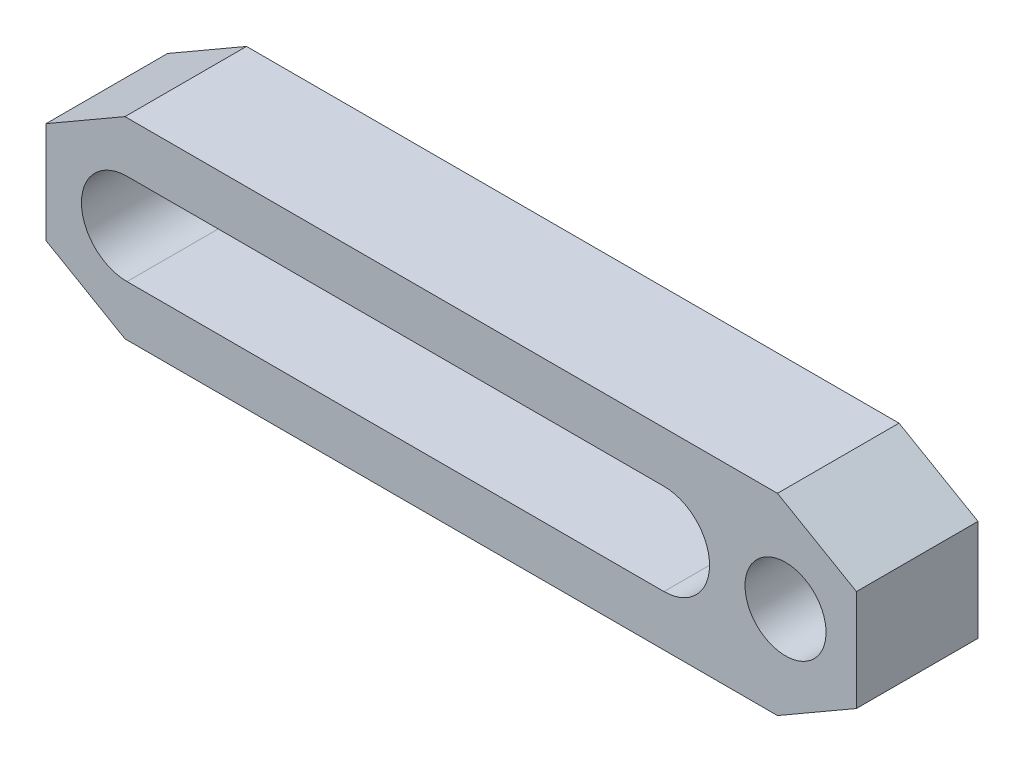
ISO-10303-21;
HEADER;
FILE_DESCRIPTION(('STEP AP214'),'2;1');
FILE_NAME('part.step','',(''),(''),'','','');
FILE_SCHEMA(('AUTOMOTIVE_DESIGN { 1 0 10303 214 1 1 1 1 }'));
ENDSEC;
DATA;
#1=APPLICATION_CONTEXT('core data for automotive mechanical design processes');
#2=APPLICATION_PROTOCOL_DEFINITION('international standard','automotive_design',2000,#1);
#3=PRODUCT_CONTEXT('',#1,'mechanical');
#4=PRODUCT('Part','Part','',(#3));
#5=PRODUCT_RELATED_PRODUCT_CATEGORY('part','',(#4));
#6=PRODUCT_DEFINITION_FORMATION('','',#4);
#7=PRODUCT_DEFINITION_CONTEXT('part definition',#1,'design');
#8=PRODUCT_DEFINITION('design','',#6,#7);
#9=PRODUCT_DEFINITION_SHAPE('','',#8);
#10=(LENGTH_UNIT() NAMED_UNIT(*) SI_UNIT(.MILLI.,.METRE.));
#11=(NAMED_UNIT(*) PLANE_ANGLE_UNIT() SI_UNIT($,.RADIAN.));
#12=(NAMED_UNIT(*) SI_UNIT($,.STERADIAN.) SOLID_ANGLE_UNIT());
#13=UNCERTAINTY_MEASURE_WITH_UNIT(LENGTH_MEASURE(1.E-05),#10,'distance_accuracy_value','');
#14=(GEOMETRIC_REPRESENTATION_CONTEXT(3) GLOBAL_UNCERTAINTY_ASSIGNED_CONTEXT((#13)) GLOBAL_UNIT_ASSIGNED_CONTEXT((#10,
#11,#12)) REPRESENTATION_CONTEXT('',''));
#15=CARTESIAN_POINT('',(0.,0.,0.));
#16=DIRECTION('',(0.,0.,1.));
#17=DIRECTION('',(1.,0.,0.));
#18=AXIS2_PLACEMENT_3D('',#15,#16,#17);
#19=CARTESIAN_POINT('',(-21.,28.0940107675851,12.));
#20=DIRECTION('',(0.,0.,1.));
#21=DIRECTION('',(0.,1.,0.));
#22=AXIS2_PLACEMENT_3D('',#19,#20,#21);
#23=PLANE('',#22);
#24=CARTESIAN_POINT('',(12.,0.,12.));
#25=DIRECTION('',(0.,0.,1.));
#26=DIRECTION('',(0.,1.,0.));
#27=AXIS2_PLACEMENT_3D('',#24,#25,#26);
#28=CIRCLE('',#27,4.);
#29=CARTESIAN_POINT('',(12.,4.,12.));
#30=VERTEX_POINT('',#29);
#31=EDGE_CURVE('E127',#30,#30,#28,.T.);
#32=ORIENTED_EDGE('',*,*,#31,.F.);
#33=EDGE_LOOP('',(#32));
#34=FACE_BOUND('',#33,.T.);
#35=DIRECTION('',(-0.866025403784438,-0.5,0.));
#36=VECTOR('',#35,1.);
#37=CARTESIAN_POINT('',(-61.,5.,12.));
#38=LINE('',#37,#36);
#39=CARTESIAN_POINT('',(-53.2057713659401,9.5,12.));
#40=VERTEX_POINT('',#39);
#41=CARTESIAN_POINT('',(-61.,5.,12.));
#42=VERTEX_POINT('',#41);
#43=EDGE_CURVE('E160',#40,#42,#38,.T.);
#44=ORIENTED_EDGE('',*,*,#43,.T.);
#45=DIRECTION('',(0.,-1.,0.));
#46=VECTOR('',#45,1.);
#47=CARTESIAN_POINT('',(-61.,-5.,12.));
#48=LINE('',#47,#46);
#49=CARTESIAN_POINT('',(-61.,-5.,12.));
#50=VERTEX_POINT('',#49);
#51=EDGE_CURVE('E163',#42,#50,#48,.T.);
#52=ORIENTED_EDGE('',*,*,#51,.T.);
#53=DIRECTION('',(0.866025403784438,-0.5,0.));
#54=VECTOR('',#53,1.);
#55=CARTESIAN_POINT('',(-61.,-5.,12.));
#56=LINE('',#55,#54);
#57=CARTESIAN_POINT('',(-53.2057713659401,-9.5,12.));
#58=VERTEX_POINT('',#57);
#59=EDGE_CURVE('E165',#50,#58,#56,.T.);
#60=ORIENTED_EDGE('',*,*,#59,.T.);
#61=DIRECTION('',(1.,0.,0.));
#62=VECTOR('',#61,1.);
#63=CARTESIAN_POINT('',(11.2057713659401,-9.5,12.));
#64=LINE('',#63,#62);
#65=CARTESIAN_POINT('',(11.2057713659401,-9.5,12.));
#66=VERTEX_POINT('',#65);
#67=EDGE_CURVE('E167',#58,#66,#64,.T.);
#68=ORIENTED_EDGE('',*,*,#67,.T.);
#69=DIRECTION('',(0.866025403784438,0.5,0.));
#70=VECTOR('',#69,1.);
#71=CARTESIAN_POINT('',(19.,-5.,12.));
#72=LINE('',#71,#70);
#73=CARTESIAN_POINT('',(19.,-5.,12.));
#74=VERTEX_POINT('',#73);
#75=EDGE_CURVE('E169',#66,#74,#72,.T.);
#76=ORIENTED_EDGE('',*,*,#75,.T.);
#77=DIRECTION('',(0.,1.,0.));
#78=VECTOR('',#77,1.);
#79=CARTESIAN_POINT('',(19.,-5.,12.));
#80=LINE('',#79,#78);
#81=CARTESIAN_POINT('',(19.,5.,12.));
#82=VERTEX_POINT('',#81);
#83=EDGE_CURVE('E171',#74,#82,#80,.T.);
#84=ORIENTED_EDGE('',*,*,#83,.T.);
#85=DIRECTION('',(-0.866025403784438,0.5,0.));
#86=VECTOR('',#85,1.);
#87=CARTESIAN_POINT('',(19.,5.,12.));
#88=LINE('',#87,#86);
#89=CARTESIAN_POINT('',(11.2057713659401,9.5,12.));
#90=VERTEX_POINT('',#89);
#91=EDGE_CURVE('E173',#82,#90,#88,.T.);
#92=ORIENTED_EDGE('',*,*,#91,.T.);
#93=DIRECTION('',(-1.,0.,0.));
#94=VECTOR('',#93,1.);
#95=CARTESIAN_POINT('',(11.2057713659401,9.5,12.));
#96=LINE('',#95,#94);
#97=EDGE_CURVE('E175',#90,#40,#96,.T.);
#98=ORIENTED_EDGE('',*,*,#97,.T.);
#99=EDGE_LOOP('',(#44,#52,#60,#68,#76,#84,#92,#98));
#100=FACE_BOUND('',#99,.T.);
#101=DIRECTION('',(-1.,0.,0.));
#102=VECTOR('',#101,1.);
#103=CARTESIAN_POINT('',(0.,4.5,12.));
#104=LINE('',#103,#102);
#105=CARTESIAN_POINT('',(0.,4.5,12.));
#106=VERTEX_POINT('',#105);
#107=CARTESIAN_POINT('',(-53.,4.5,12.));
#108=VERTEX_POINT('',#107);
#109=EDGE_CURVE('E134',#106,#108,#104,.T.);
#110=ORIENTED_EDGE('',*,*,#109,.F.);
#111=CARTESIAN_POINT('',(0.,0.,12.));
#112=DIRECTION('',(0.,0.,1.));
#113=DIRECTION('',(0.,1.,0.));
#114=AXIS2_PLACEMENT_3D('',#111,#112,#113);
#115=CIRCLE('',#114,4.5);
#116=CARTESIAN_POINT('',(0.,-4.5,12.));
#117=VERTEX_POINT('',#116);
#118=EDGE_CURVE('E118',#117,#106,#115,.T.);
#119=ORIENTED_EDGE('',*,*,#118,.F.);
#120=DIRECTION('',(1.,0.,0.));
#121=VECTOR('',#120,1.);
#122=CARTESIAN_POINT('',(0.,-4.5,12.));
#123=LINE('',#122,#121);
#124=CARTESIAN_POINT('',(-53.,-4.5,12.));
#125=VERTEX_POINT('',#124);
#126=EDGE_CURVE('E138',#125,#117,#123,.T.);
#127=ORIENTED_EDGE('',*,*,#126,.F.);
#128=CARTESIAN_POINT('',(-53.,0.,12.));
#129=DIRECTION('',(0.,0.,1.));
#130=DIRECTION('',(0.,1.,0.));
#131=AXIS2_PLACEMENT_3D('',#128,#129,#130);
#132=CIRCLE('',#131,4.5);
#133=EDGE_CURVE('E136',#108,#125,#132,.T.);
#134=ORIENTED_EDGE('',*,*,#133,.F.);
#135=EDGE_LOOP('',(#110,#119,#127,#134));
#136=FACE_BOUND('',#135,.T.);
#137=ADVANCED_FACE('F14',(#34,#100,#136),#23,.T.);
#138=CARTESIAN_POINT('',(-21.,28.0940107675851,0.));
#139=DIRECTION('',(0.,0.,1.));
#140=DIRECTION('',(0.,1.,0.));
#141=AXIS2_PLACEMENT_3D('',#138,#139,#140);
#142=PLANE('',#141);
#143=CARTESIAN_POINT('',(12.,0.,0.));
#144=DIRECTION('',(0.,0.,1.));
#145=DIRECTION('',(0.,1.,0.));
#146=AXIS2_PLACEMENT_3D('',#143,#144,#145);
#147=CIRCLE('',#146,4.);
#148=CARTESIAN_POINT('',(12.,4.,0.));
#149=VERTEX_POINT('',#148);
#150=EDGE_CURVE('E124',#149,#149,#147,.T.);
#151=ORIENTED_EDGE('',*,*,#150,.T.);
#152=EDGE_LOOP('',(#151));
#153=FACE_BOUND('',#152,.T.);
#154=DIRECTION('',(-0.866025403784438,-0.5,0.));
#155=VECTOR('',#154,1.);
#156=CARTESIAN_POINT('',(-61.,5.,0.));
#157=LINE('',#156,#155);
#158=CARTESIAN_POINT('',(-53.2057713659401,9.5,0.));
#159=VERTEX_POINT('',#158);
#160=CARTESIAN_POINT('',(-61.,5.,0.));
#161=VERTEX_POINT('',#160);
#162=EDGE_CURVE('E119',#159,#161,#157,.T.);
#163=ORIENTED_EDGE('',*,*,#162,.F.);
#164=DIRECTION('',(-1.,0.,0.));
#165=VECTOR('',#164,1.);
#166=CARTESIAN_POINT('',(11.2057713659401,9.5,0.));
#167=LINE('',#166,#165);
#168=CARTESIAN_POINT('',(11.2057713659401,9.5,0.));
#169=VERTEX_POINT('',#168);
#170=EDGE_CURVE('E158',#169,#159,#167,.T.);
#171=ORIENTED_EDGE('',*,*,#170,.F.);
#172=DIRECTION('',(-0.866025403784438,0.5,0.));
#173=VECTOR('',#172,1.);
#174=CARTESIAN_POINT('',(19.,5.,0.));
#175=LINE('',#174,#173);
#176=CARTESIAN_POINT('',(19.,5.,0.));
#177=VERTEX_POINT('',#176);
#178=EDGE_CURVE('E156',#177,#169,#175,.T.);
#179=ORIENTED_EDGE('',*,*,#178,.F.);
#180=DIRECTION('',(0.,1.,0.));
#181=VECTOR('',#180,1.);
#182=CARTESIAN_POINT('',(19.,-5.,0.));
#183=LINE('',#182,#181);
#184=CARTESIAN_POINT('',(19.,-5.,0.));
#185=VERTEX_POINT('',#184);
#186=EDGE_CURVE('E154',#185,#177,#183,.T.);
#187=ORIENTED_EDGE('',*,*,#186,.F.);
#188=DIRECTION('',(0.866025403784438,0.5,0.));
#189=VECTOR('',#188,1.);
#190=CARTESIAN_POINT('',(19.,-5.,0.));
#191=LINE('',#190,#189);
#192=CARTESIAN_POINT('',(11.2057713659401,-9.5,0.));
#193=VERTEX_POINT('',#192);
#194=EDGE_CURVE('E152',#193,#185,#191,.T.);
#195=ORIENTED_EDGE('',*,*,#194,.F.);
#196=DIRECTION('',(1.,0.,0.));
#197=VECTOR('',#196,1.);
#198=CARTESIAN_POINT('',(11.2057713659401,-9.5,0.));
#199=LINE('',#198,#197);
#200=CARTESIAN_POINT('',(-53.2057713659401,-9.5,0.));
#201=VERTEX_POINT('',#200);
#202=EDGE_CURVE('E150',#201,#193,#199,.T.);
#203=ORIENTED_EDGE('',*,*,#202,.F.);
#204=DIRECTION('',(0.866025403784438,-0.5,0.));
#205=VECTOR('',#204,1.);
#206=CARTESIAN_POINT('',(-61.,-5.,0.));
#207=LINE('',#206,#205);
#208=CARTESIAN_POINT('',(-61.,-5.,0.));
#209=VERTEX_POINT('',#208);
#210=EDGE_CURVE('E148',#209,#201,#207,.T.);
#211=ORIENTED_EDGE('',*,*,#210,.F.);
#212=DIRECTION('',(0.,-1.,0.));
#213=VECTOR('',#212,1.);
#214=CARTESIAN_POINT('',(-61.,-5.,0.));
#215=LINE('',#214,#213);
#216=EDGE_CURVE('E146',#161,#209,#215,.T.);
#217=ORIENTED_EDGE('',*,*,#216,.F.);
#218=EDGE_LOOP('',(#163,#171,#179,#187,#195,#203,#211,#217));
#219=FACE_BOUND('',#218,.T.);
#220=CARTESIAN_POINT('',(0.,0.,0.));
#221=DIRECTION('',(0.,0.,1.));
#222=DIRECTION('',(0.,1.,0.));
#223=AXIS2_PLACEMENT_3D('',#220,#221,#222);
#224=CIRCLE('',#223,4.5);
#225=CARTESIAN_POINT('',(0.,-4.5,0.));
#226=VERTEX_POINT('',#225);
#227=CARTESIAN_POINT('',(0.,4.5,0.));
#228=VERTEX_POINT('',#227);
#229=EDGE_CURVE('E37',#226,#228,#224,.T.);
#230=ORIENTED_EDGE('',*,*,#229,.T.);
#231=DIRECTION('',(-1.,0.,0.));
#232=VECTOR('',#231,1.);
#233=CARTESIAN_POINT('',(0.,4.5,0.));
#234=LINE('',#233,#232);
#235=CARTESIAN_POINT('',(-53.,4.5,0.));
#236=VERTEX_POINT('',#235);
#237=EDGE_CURVE('E105',#228,#236,#234,.T.);
#238=ORIENTED_EDGE('',*,*,#237,.T.);
#239=CARTESIAN_POINT('',(-53.,0.,0.));
#240=DIRECTION('',(0.,0.,1.));
#241=DIRECTION('',(0.,1.,0.));
#242=AXIS2_PLACEMENT_3D('',#239,#240,#241);
#243=CIRCLE('',#242,4.5);
#244=CARTESIAN_POINT('',(-53.,-4.5,0.));
#245=VERTEX_POINT('',#244);
#246=EDGE_CURVE('E114',#236,#245,#243,.T.);
#247=ORIENTED_EDGE('',*,*,#246,.T.);
#248=DIRECTION('',(1.,0.,0.));
#249=VECTOR('',#248,1.);
#250=CARTESIAN_POINT('',(0.,-4.5,0.));
#251=LINE('',#250,#249);
#252=EDGE_CURVE('E123',#245,#226,#251,.T.);
#253=ORIENTED_EDGE('',*,*,#252,.T.);
#254=EDGE_LOOP('',(#230,#238,#247,#253));
#255=FACE_BOUND('',#254,.T.);
#256=ADVANCED_FACE('F122',(#153,#219,#255),#142,.F.);
#257=CARTESIAN_POINT('',(-61.,5.,12.));
#258=DIRECTION('',(0.5,-0.866025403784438,0.));
#259=DIRECTION('',(0.866025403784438,0.5,0.));
#260=AXIS2_PLACEMENT_3D('',#257,#258,#259);
#261=PLANE('',#260);
#262=ORIENTED_EDGE('',*,*,#162,.T.);
#263=DIRECTION('',(0.,0.,-1.));
#264=VECTOR('',#263,1.);
#265=CARTESIAN_POINT('',(-61.,5.,12.));
#266=LINE('',#265,#264);
#267=EDGE_CURVE('E9',#42,#161,#266,.T.);
#268=ORIENTED_EDGE('',*,*,#267,.F.);
#269=ORIENTED_EDGE('',*,*,#43,.F.);
#270=DIRECTION('',(0.,0.,-1.));
#271=VECTOR('',#270,1.);
#272=CARTESIAN_POINT('',(-53.2057713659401,9.5,12.));
#273=LINE('',#272,#271);
#274=EDGE_CURVE('E177',#40,#159,#273,.T.);
#275=ORIENTED_EDGE('',*,*,#274,.T.);
#276=EDGE_LOOP('',(#262,#268,#269,#275));
#277=FACE_BOUND('',#276,.T.);
#278=ADVANCED_FACE('F16',(#277),#261,.F.);
#279=CARTESIAN_POINT('',(-61.,-5.,12.));
#280=DIRECTION('',(1.,0.,0.));
#281=DIRECTION('',(0.,1.,0.));
#282=AXIS2_PLACEMENT_3D('',#279,#280,#281);
#283=PLANE('',#282);
#284=ORIENTED_EDGE('',*,*,#216,.T.);
#285=DIRECTION('',(0.,0.,-1.));
#286=VECTOR('',#285,1.);
#287=CARTESIAN_POINT('',(-61.,-5.,12.));
#288=LINE('',#287,#286);
#289=EDGE_CURVE('E22',#50,#209,#288,.T.);
#290=ORIENTED_EDGE('',*,*,#289,.F.);
#291=ORIENTED_EDGE('',*,*,#51,.F.);
#292=ORIENTED_EDGE('',*,*,#267,.T.);
#293=EDGE_LOOP('',(#284,#290,#291,#292));
#294=FACE_BOUND('',#293,.T.);
#295=ADVANCED_FACE('F221',(#294),#283,.F.);
#296=CARTESIAN_POINT('',(-61.,-5.,12.));
#297=DIRECTION('',(0.5,0.866025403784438,0.));
#298=DIRECTION('',(-0.866025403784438,0.5,0.));
#299=AXIS2_PLACEMENT_3D('',#296,#297,#298);
#300=PLANE('',#299);
#301=ORIENTED_EDGE('',*,*,#210,.T.);
#302=DIRECTION('',(0.,0.,-1.));
#303=VECTOR('',#302,1.);
#304=CARTESIAN_POINT('',(-53.2057713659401,-9.5,12.));
#305=LINE('',#304,#303);
#306=EDGE_CURVE('E192',#58,#201,#305,.T.);
#307=ORIENTED_EDGE('',*,*,#306,.F.);
#308=ORIENTED_EDGE('',*,*,#59,.F.);
#309=ORIENTED_EDGE('',*,*,#289,.T.);
#310=EDGE_LOOP('',(#301,#307,#308,#309));
#311=FACE_BOUND('',#310,.T.);
#312=ADVANCED_FACE('F199',(#311),#300,.F.);
#313=CARTESIAN_POINT('',(11.2057713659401,-9.5,12.));
#314=DIRECTION('',(0.,1.,0.));
#315=DIRECTION('',(-1.,0.,0.));
#316=AXIS2_PLACEMENT_3D('',#313,#314,#315);
#317=PLANE('',#316);
#318=ORIENTED_EDGE('',*,*,#202,.T.);
#319=DIRECTION('',(0.,0.,-1.));
#320=VECTOR('',#319,1.);
#321=CARTESIAN_POINT('',(11.2057713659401,-9.5,12.));
#322=LINE('',#321,#320);
#323=EDGE_CURVE('E189',#66,#193,#322,.T.);
#324=ORIENTED_EDGE('',*,*,#323,.F.);
#325=ORIENTED_EDGE('',*,*,#67,.F.);
#326=ORIENTED_EDGE('',*,*,#306,.T.);
#327=EDGE_LOOP('',(#318,#324,#325,#326));
#328=FACE_BOUND('',#327,.T.);
#329=ADVANCED_FACE('F209',(#328),#317,.F.);
#330=CARTESIAN_POINT('',(19.,-5.,12.));
#331=DIRECTION('',(-0.5,0.866025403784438,0.));
#332=DIRECTION('',(-0.866025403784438,-0.5,0.));
#333=AXIS2_PLACEMENT_3D('',#330,#331,#332);
#334=PLANE('',#333);
#335=ORIENTED_EDGE('',*,*,#194,.T.);
#336=DIRECTION('',(0.,0.,-1.));
#337=VECTOR('',#336,1.);
#338=CARTESIAN_POINT('',(19.,-5.,12.));
#339=LINE('',#338,#337);
#340=EDGE_CURVE('E186',#74,#185,#339,.T.);
#341=ORIENTED_EDGE('',*,*,#340,.F.);
#342=ORIENTED_EDGE('',*,*,#75,.F.);
#343=ORIENTED_EDGE('',*,*,#323,.T.);
#344=EDGE_LOOP('',(#335,#341,#342,#343));
#345=FACE_BOUND('',#344,.T.);
#346=ADVANCED_FACE('F213',(#345),#334,.F.);
#347=CARTESIAN_POINT('',(19.,-5.,12.));
#348=DIRECTION('',(-1.,0.,0.));
#349=DIRECTION('',(0.,-1.,0.));
#350=AXIS2_PLACEMENT_3D('',#347,#348,#349);
#351=PLANE('',#350);
#352=ORIENTED_EDGE('',*,*,#186,.T.);
#353=DIRECTION('',(0.,0.,-1.));
#354=VECTOR('',#353,1.);
#355=CARTESIAN_POINT('',(19.,5.,12.));
#356=LINE('',#355,#354);
#357=EDGE_CURVE('E183',#82,#177,#356,.T.);
#358=ORIENTED_EDGE('',*,*,#357,.F.);
#359=ORIENTED_EDGE('',*,*,#83,.F.);
#360=ORIENTED_EDGE('',*,*,#340,.T.);
#361=EDGE_LOOP('',(#352,#358,#359,#360));
#362=FACE_BOUND('',#361,.T.);
#363=ADVANCED_FACE('F234',(#362),#351,.F.);
#364=CARTESIAN_POINT('',(19.,5.,12.));
#365=DIRECTION('',(-0.5,-0.866025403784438,0.));
#366=DIRECTION('',(0.866025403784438,-0.5,0.));
#367=AXIS2_PLACEMENT_3D('',#364,#365,#366);
#368=PLANE('',#367);
#369=ORIENTED_EDGE('',*,*,#178,.T.);
#370=DIRECTION('',(0.,0.,-1.));
#371=VECTOR('',#370,1.);
#372=CARTESIAN_POINT('',(11.2057713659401,9.5,12.));
#373=LINE('',#372,#371);
#374=EDGE_CURVE('E180',#90,#169,#373,.T.);
#375=ORIENTED_EDGE('',*,*,#374,.F.);
#376=ORIENTED_EDGE('',*,*,#91,.F.);
#377=ORIENTED_EDGE('',*,*,#357,.T.);
#378=EDGE_LOOP('',(#369,#375,#376,#377));
#379=FACE_BOUND('',#378,.T.);
#380=ADVANCED_FACE('F232',(#379),#368,.F.);
#381=CARTESIAN_POINT('',(11.2057713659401,9.5,12.));
#382=DIRECTION('',(0.,-1.,0.));
#383=DIRECTION('',(1.,0.,0.));
#384=AXIS2_PLACEMENT_3D('',#381,#382,#383);
#385=PLANE('',#384);
#386=ORIENTED_EDGE('',*,*,#170,.T.);
#387=ORIENTED_EDGE('',*,*,#274,.F.);
#388=ORIENTED_EDGE('',*,*,#97,.F.);
#389=ORIENTED_EDGE('',*,*,#374,.T.);
#390=EDGE_LOOP('',(#386,#387,#388,#389));
#391=FACE_BOUND('',#390,.T.);
#392=ADVANCED_FACE('F227',(#391),#385,.F.);
#393=CARTESIAN_POINT('',(0.,0.,12.));
#394=DIRECTION('',(0.,0.,-1.));
#395=DIRECTION('',(0.,-1.,0.));
#396=AXIS2_PLACEMENT_3D('',#393,#394,#395);
#397=CYLINDRICAL_SURFACE('',#396,4.5);
#398=ORIENTED_EDGE('',*,*,#229,.F.);
#399=DIRECTION('',(0.,0.,-1.));
#400=VECTOR('',#399,1.);
#401=CARTESIAN_POINT('',(0.,-4.5,12.));
#402=LINE('',#401,#400);
#403=EDGE_CURVE('E140',#117,#226,#402,.T.);
#404=ORIENTED_EDGE('',*,*,#403,.F.);
#405=ORIENTED_EDGE('',*,*,#118,.T.);
#406=DIRECTION('',(0.,0.,-1.));
#407=VECTOR('',#406,1.);
#408=CARTESIAN_POINT('',(0.,4.5,12.));
#409=LINE('',#408,#407);
#410=EDGE_CURVE('E107',#106,#228,#409,.T.);
#411=ORIENTED_EDGE('',*,*,#410,.T.);
#412=EDGE_LOOP('',(#398,#404,#405,#411));
#413=FACE_BOUND('',#412,.T.);
#414=ADVANCED_FACE('F116',(#413),#397,.F.);
#415=CARTESIAN_POINT('',(0.,4.5,12.));
#416=DIRECTION('',(0.,-1.,0.));
#417=DIRECTION('',(1.,0.,0.));
#418=AXIS2_PLACEMENT_3D('',#415,#416,#417);
#419=PLANE('',#418);
#420=ORIENTED_EDGE('',*,*,#237,.F.);
#421=ORIENTED_EDGE('',*,*,#410,.F.);
#422=ORIENTED_EDGE('',*,*,#109,.T.);
#423=DIRECTION('',(0.,0.,-1.));
#424=VECTOR('',#423,1.);
#425=CARTESIAN_POINT('',(-53.,4.5,12.));
#426=LINE('',#425,#424);
#427=EDGE_CURVE('E110',#108,#236,#426,.T.);
#428=ORIENTED_EDGE('',*,*,#427,.T.);
#429=EDGE_LOOP('',(#420,#421,#422,#428));
#430=FACE_BOUND('',#429,.T.);
#431=ADVANCED_FACE('F106',(#430),#419,.T.);
#432=CARTESIAN_POINT('',(-53.,0.,12.));
#433=DIRECTION('',(0.,0.,-1.));
#434=DIRECTION('',(0.,-1.,0.));
#435=AXIS2_PLACEMENT_3D('',#432,#433,#434);
#436=CYLINDRICAL_SURFACE('',#435,4.5);
#437=ORIENTED_EDGE('',*,*,#246,.F.);
#438=ORIENTED_EDGE('',*,*,#427,.F.);
#439=ORIENTED_EDGE('',*,*,#133,.T.);
#440=DIRECTION('',(0.,0.,-1.));
#441=VECTOR('',#440,1.);
#442=CARTESIAN_POINT('',(-53.,-4.5,12.));
#443=LINE('',#442,#441);
#444=EDGE_CURVE('E29',#125,#245,#443,.T.);
#445=ORIENTED_EDGE('',*,*,#444,.T.);
#446=EDGE_LOOP('',(#437,#438,#439,#445));
#447=FACE_BOUND('',#446,.T.);
#448=ADVANCED_FACE('F262',(#447),#436,.F.);
#449=CARTESIAN_POINT('',(0.,-4.5,12.));
#450=DIRECTION('',(0.,1.,0.));
#451=DIRECTION('',(-1.,0.,0.));
#452=AXIS2_PLACEMENT_3D('',#449,#450,#451);
#453=PLANE('',#452);
#454=ORIENTED_EDGE('',*,*,#252,.F.);
#455=ORIENTED_EDGE('',*,*,#444,.F.);
#456=ORIENTED_EDGE('',*,*,#126,.T.);
#457=ORIENTED_EDGE('',*,*,#403,.T.);
#458=EDGE_LOOP('',(#454,#455,#456,#457));
#459=FACE_BOUND('',#458,.T.);
#460=ADVANCED_FACE('F267',(#459),#453,.T.);
#461=CARTESIAN_POINT('',(12.,0.,12.));
#462=DIRECTION('',(0.,0.,1.));
#463=DIRECTION('',(0.,1.,0.));
#464=AXIS2_PLACEMENT_3D('',#461,#462,#463);
#465=CYLINDRICAL_SURFACE('',#464,4.);
#466=ORIENTED_EDGE('',*,*,#150,.F.);
#467=EDGE_LOOP('',(#466));
#468=FACE_BOUND('',#467,.T.);
#469=ORIENTED_EDGE('',*,*,#31,.T.);
#470=EDGE_LOOP('',(#469));
#471=FACE_BOUND('',#470,.T.);
#472=ADVANCED_FACE('F271',(#468,#471),#465,.F.);
#473=CLOSED_SHELL('',(#137,#256,#278,#295,#312,#329,#346,#363,#380,#392,#414,#431,#448,#460,#472));
#474=MANIFOLD_SOLID_BREP('B1',#473);
#475=ADVANCED_BREP_SHAPE_REPRESENTATION('',(#18,#474),#14);
#476=SHAPE_DEFINITION_REPRESENTATION(#9,#475);
ENDSEC;
END-ISO-10303-21;
